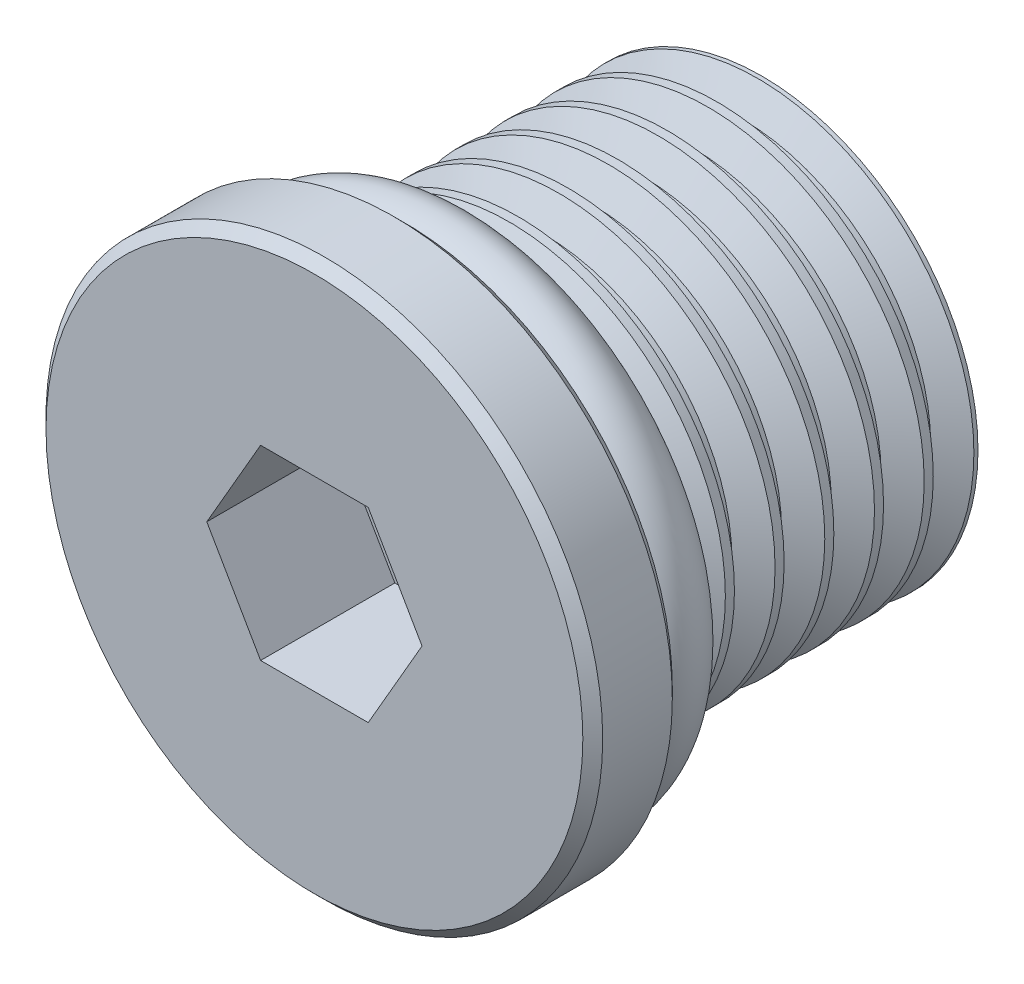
from build123d import *

# Parameters (mm, degrees)
SKETCH1_R               = 7.112
BASE_EXTRUDE_DEPTH      = 2.286
SKETCH2_R               = 4.826
BOSS_EXTRUDE1_DEPTH     = 2.286
CUT_EXTRUDE1_DEPTH      = 16.805250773
CUT_EXTRUDE1_DEPTH_BACK = 16.805250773
CHAMFER2_SIZE           = 0.254
CUT_EXTRUDE2_DEPTH      = 3.429
SKETCH6_R               = 0.9144


with BuildPart() as part:
    # Sketch1 → Base-Extrude (new body)
    with BuildSketch(Plane.XY):
        Circle(SKETCH1_R)
    extrude(amount=-BASE_EXTRUDE_DEPTH)

    # Sketch2 → Boss-Extrude1 (add)
    with BuildSketch(Plane(origin=(0, 0, -2.286), x_dir=(-1, 0, 0), z_dir=(0, 0, -1))):
        with Locations(Location((0, 0, 0), (0, 0, 180))):
            Circle(SKETCH2_R)
    extrude(amount=BOSS_EXTRUDE1_DEPTH)

    # Sketch3 → Boss-Revolve1 (revolve)
    with BuildSketch(Plane(origin=(0, 0, 0), x_dir=(0, 0, -1), z_dir=(1, 0, 0)), mode=Mode.PRIVATE) as boss_revolve1_sk:
        Polygon((4.572, 4.826), (4.975279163, 5.5245), (5.207, 5.5245), (5.610279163, 4.826), (5.842, 4.826), (6.245279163, 5.5245), (6.477, 5.5245), (6.880279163, 4.826), (7.112, 4.826), (7.515279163, 5.5245), (7.747, 5.5245), (8.150279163, 4.826), (8.382, 4.826), (8.785279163, 5.5245), (9.017, 5.5245), (9.420279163, 4.826), (9.652, 4.826), (10.055279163, 5.5245), (10.287, 5.5245), (10.690279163, 4.826), (10.922, 4.826), (11.325279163, 5.5245), (11.557, 5.5245), (11.960279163, 4.826), (12.192, 4.826), (12.192, 0), (4.572, 0), align=None)
    revolve(boss_revolve1_sk.sketch.rotate(Axis((0, 0, 1.041198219), (0, 0, -1)), 90), axis=Axis((0, 0, 1.041198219), (0, 0, -1)))

    # Sketch4 → Cut-Extrude1 (cut, two sides: drawn at the far end of the back side and taken through both)
    with BuildSketch(Plane(origin=(0, 0, 0), x_dir=(0, 0, -1), z_dir=(1, 0, 0)).offset(-CUT_EXTRUDE1_DEPTH_BACK)):
        Polygon((11.43, 53.66023773), (11.43, 7.132889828), (11.43, -7.043867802), (11.43, -53.571215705), (104.484695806, -53.571215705), (104.484695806, 53.66023773), align=None)
    extrude(amount=CUT_EXTRUDE1_DEPTH + CUT_EXTRUDE1_DEPTH_BACK, mode=Mode.SUBTRACT)

    # Chamfer2
    chamfer2_edges = [part.edges().sort_by_distance(p)[0] for p in [
        (-7.112, 0, 0),
        (-7.112, 0, -2.286),
    ]]
    chamfer(chamfer2_edges, length=CHAMFER2_SIZE)

    # Sketch5 → Cut-Extrude2 (cut)
    with BuildSketch(Plane.XY):
        Polygon((2.749630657, 0), (1.374815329, 2.38125), (-1.374815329, 2.38125), (-2.749630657, 0), (-1.374815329, -2.38125), (1.374815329, -2.38125), align=None)
    extrude(amount=-CUT_EXTRUDE2_DEPTH, mode=Mode.SUBTRACT)

    # Sketch6 → Boss-Revolve2 (revolve)
    with BuildSketch(Plane(origin=(0, 0, 0), x_dir=(0, 0, -1), z_dir=(1, 0, 0)), mode=Mode.PRIVATE) as boss_revolve2_sk:
        with Locations((3.175, 5.715)):
            Circle(SKETCH6_R)
    revolve(boss_revolve2_sk.sketch.rotate(Axis((0, 0, 0.906013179), (0, 0, -1)), 90), axis=Axis((0, 0, 0.906013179), (0, 0, -1)))


solid = part.part
